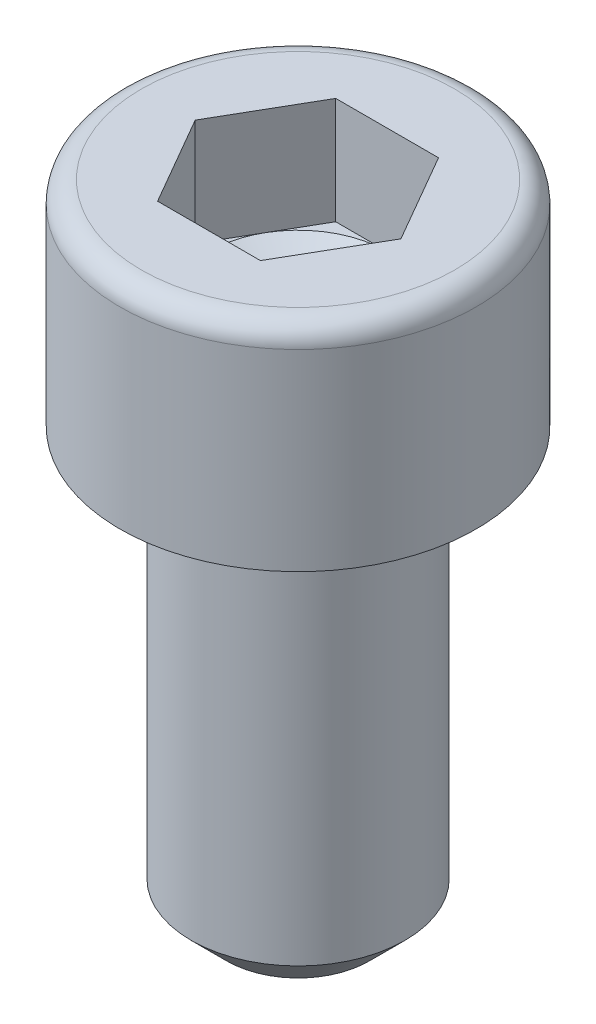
from build123d import *

# Parameters (mm, degrees)
TIGE_START              = -12
ESQUISSE1_R             = 3
TIGE_DEPTH              = 12
CHANFREIN_D_ENTR_E_SIZE = 1
HEXAGONE_DEPTH          = 3


with BuildPart() as part:
    # Esquisse1 → Tige (new body)
    with BuildSketch(Plane(origin=(0, 0, 0), x_dir=(1, 0, 0), z_dir=(0, 1, 0)).offset(TIGE_START)):
        with Locations(Location((0, 0, 0), (0, 0, 270))):
            Circle(ESQUISSE1_R)
    extrude(amount=TIGE_DEPTH)

    # Chanfrein d_entr_e
    chanfrein_d_entr_e_edges = [part.edges().sort_by_distance(p)[0] for p in [
        (0, -12, -3),
    ]]
    chamfer(chanfrein_d_entr_e_edges, length=CHANFREIN_D_ENTR_E_SIZE)

    # Esquisse2 → T_te (revolve)
    with BuildSketch(Plane.XY, mode=Mode.PRIVATE) as t_te_sk:
        with BuildLine():
            Line((2.5, 6), (2.5, 3))
            Line((2.5, 3), (0, 1.556624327))
            Line((0, 1.556624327), (0, 0))
            Line((0, 0), (5, 0))
            Line((5, 0), (5, 5.4))
            ThreePointArc((5, 5.4), (4.824264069, 5.824264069), (4.4, 6))
            Line((4.4, 6), (2.5, 6))
        make_face()
    revolve(t_te_sk.sketch.rotate(Axis((0, 6, 0), (0, -1, 0)), 180), axis=Axis((0, 6, 0), (0, -1, 0)))

    # Esquisse3 → Hexagone (cut)
    with BuildSketch(Plane(origin=(0, 6, -3), x_dir=(1, 0, 0), z_dir=(0, -1, 0))):
        Polygon((1.443375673, 5.5), (-1.443375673, 5.5), (-2.886751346, 3), (-1.443375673, 0.5), (1.443375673, 0.5), (2.886751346, 3), align=None)
    extrude(amount=HEXAGONE_DEPTH, mode=Mode.SUBTRACT)


solid = part.part
